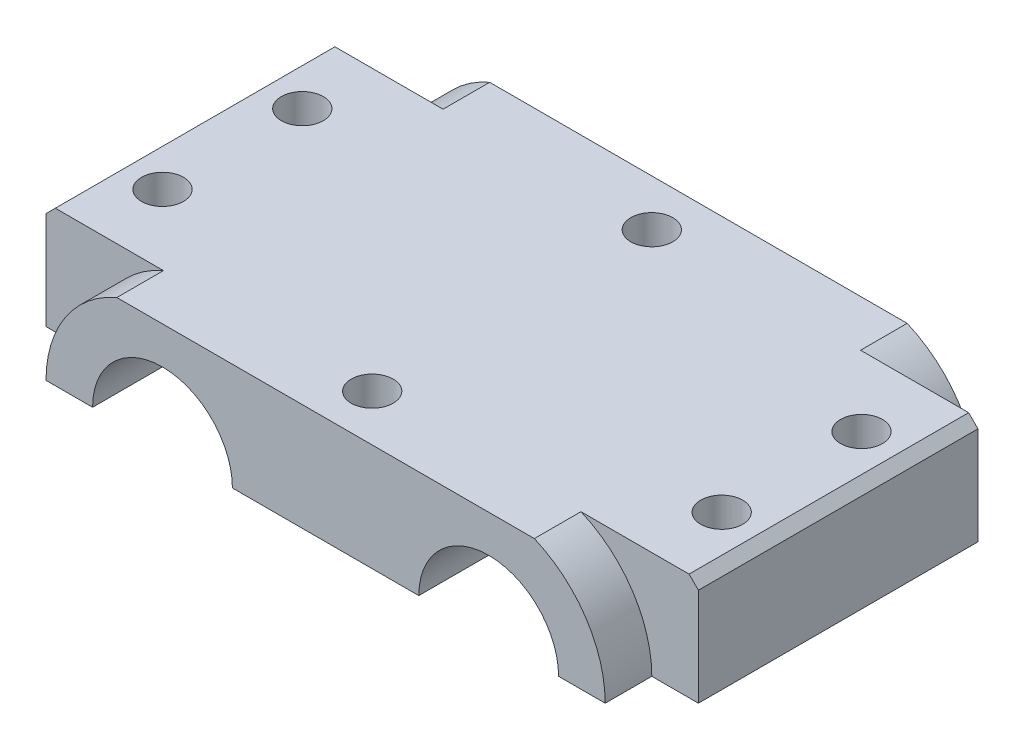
from build123d import *

# Parameters (mm, degrees)
SKETCH1_W           = 70
SKETCH1_H           = 30
BOSS_EXTRUDE1_DEPTH = 11.5
SKETCH2_R           = 2.25
CUT_EXTRUDE1_DEPTH  = 40.777506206
BOSS_EXTRUDE2_DEPTH = 5
CUT_EXTRUDE2_START  = -67
SKETCH4_R           = 7.5
CUT_EXTRUDE2_DEPTH  = 67
CHAMFER1_SIZE       = 1
SKETCH5_R           = 2.25
CUT_EXTRUDE3_DEPTH  = 42.919565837


with BuildPart() as part:
    # Sketch1 → Boss-Extrude1 (new body)
    with BuildSketch(Plane(origin=(0, 0, 0), x_dir=(1, 0, 0), z_dir=(0, 1, 0))):
        Rectangle(SKETCH1_W, SKETCH1_H)
    extrude(amount=BOSS_EXTRUDE1_DEPTH)

    # Sketch2 → Cut-Extrude1 (cut, through all)
    with BuildSketch(Plane(origin=(0, 11.5, 0), x_dir=(1, 0, 0), z_dir=(0, 1, 0))):
        with Locations(Location((-30, 7.5, 0), (0, 0, 270))):
            Circle(SKETCH2_R)
        with Locations(Location((-30, -7.5, 0), (0, 0, 270))):
            Circle(SKETCH2_R)
        with Locations(Location((30, 7.5, 0), (0, 0, 270))):
            Circle(SKETCH2_R)
        with Locations(Location((30, -7.5, 0), (0, 0, 270))):
            Circle(SKETCH2_R)
    extrude(amount=-CUT_EXTRUDE1_DEPTH, mode=Mode.SUBTRACT)

    # Sketch3 → Boss-Extrude2 (add)
    with BuildSketch(Plane.XY.offset(15)):
        with BuildLine():
            Line((-30, 0), (-25, 0))
            ThreePointArc((-25, 0), (-17.5, 7.5), (-10, 0))
            Line((-10, 0), (10, 0))
            ThreePointArc((10, 0), (17.5, 7.5), (25, 0))
            Line((25, 0), (30, 0))
            ThreePointArc((30, 0), (27.928020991, 6.892487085), (22.398979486, 11.5))
            Line((22.398979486, 11.5), (-22.398979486, 11.5))
            ThreePointArc((-22.398979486, 11.5), (-27.928020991, 6.892487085), (-30, 0))
        make_face()
    boss_extrude2 = extrude(amount=BOSS_EXTRUDE2_DEPTH)

    # Sketch4 → Cut-Extrude2 (cut)
    with BuildSketch(Plane.XY.offset(20).offset(CUT_EXTRUDE2_START)):
        with Locations((-17.5, 0)):
            Circle(SKETCH4_R)
        with Locations((17.5, 0)):
            Circle(SKETCH4_R)
    extrude(amount=CUT_EXTRUDE2_DEPTH, mode=Mode.SUBTRACT)

    # Mirror1: Boss-Extrude2 across plane
    add(boss_extrude2.mirror(Plane.XY))

    # Chamfer1
    chamfer1_edges = [part.edges().sort_by_distance(p)[0] for p in [
        (-35, 11.5, 0),
        (35, 11.5, 0),
    ]]
    chamfer(chamfer1_edges, length=CHAMFER1_SIZE)

    # Sketch5 → Cut-Extrude3 (cut, through all)
    with BuildSketch(Plane(origin=(0, 11.5, 0), x_dir=(1, 0, 0), z_dir=(0, 1, 0))):
        with Locations(Location((0, 15, 0), (0, 0, 270))):
            Circle(SKETCH5_R)
        with Locations(Location((0, -15, 0), (0, 0, 270))):
            Circle(SKETCH5_R)
    extrude(amount=-CUT_EXTRUDE3_DEPTH, mode=Mode.SUBTRACT)


solid = part.part
